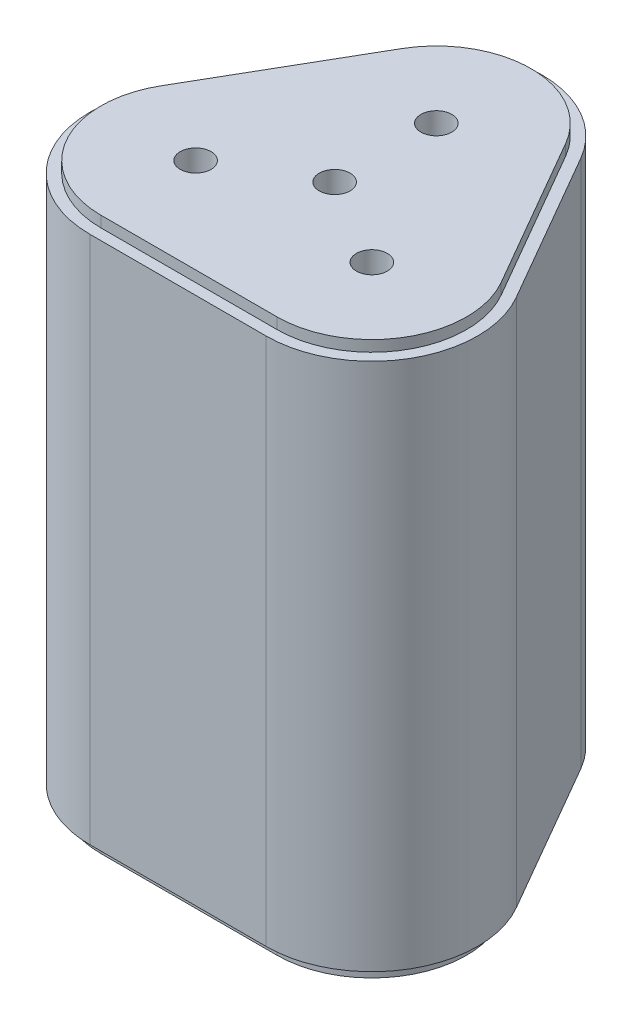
from build123d import *

# Parameters (mm, degrees)
EXTRUDE_1_DEPTH     = 60
CUT_EXTRUDE_1_DEPTH = 57
EXTRUDE_START       = 1.5
EXTRUDE_2_DEPTH     = 1.5
EXTRUDE_3_DEPTH     = 1.25
SKETCH_8_R          = 1.75
CUT_EXTRUDE_2_DEPTH = 67.788557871
SKETCH_9_R          = 1.75
CUT_EXTRUDE_3_DEPTH = 67.788557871


with BuildPart() as part:
    # Sketch 1 → Extrude 1 (new body)
    with BuildSketch(Plane(origin=(0, 0, 0), x_dir=(1, 0, 0), z_dir=(0, 1, 0))):
        with BuildLine():
            Line((10.392304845, 17.547005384), (20.392304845, 0.226497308))
            ThreePointArc((20.392304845, 0.226497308), (20.392304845, -11.773502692), (10, -17.773502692))
            Line((10, -17.773502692), (-10, -17.773502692))
            ThreePointArc((-10, -17.773502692), (-20.392304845, -11.773502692), (-20.392304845, 0.226497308))
            Line((-20.392304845, 0.226497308), (-10.392304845, 17.547005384))
            ThreePointArc((-10.392304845, 17.547005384), (0, 23.547005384), (10.392304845, 17.547005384))
        make_face()
    extrude(amount=EXTRUDE_1_DEPTH)

    # Sketch 2 → Cut-Extrude 1 (cut)
    with BuildSketch(Plane.XZ):
        with BuildLine():
            Line((-10, 15.273502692), (10, 15.273502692))
            ThreePointArc((10, 15.273502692), (18.227241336, 10.523502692), (18.227241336, 1.023502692))
            Line((18.227241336, 1.023502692), (8.227241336, -16.297005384))
            ThreePointArc((8.227241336, -16.297005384), (0, -21.047005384), (-8.227241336, -16.297005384))
            Line((-8.227241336, -16.297005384), (-18.227241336, 1.023502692))
            ThreePointArc((-18.227241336, 1.023502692), (-18.227241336, 10.523502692), (-10, 15.273502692))
        make_face()
    extrude(amount=-CUT_EXTRUDE_1_DEPTH, mode=Mode.SUBTRACT)

    # Sketch 3 → Extrude 2 (add)
    with BuildSketch(Plane.XZ.offset(EXTRUDE_START)):
        with BuildLine():
            Line((9.309773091, -16.922005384), (19.309773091, 0.398502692))
            ThreePointArc((19.309773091, 0.398502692), (19.309773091, 11.148502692), (10, 16.523502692))
            Line((10, 16.523502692), (-10, 16.523502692))
            ThreePointArc((-10, 16.523502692), (-19.309773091, 11.148502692), (-19.309773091, 0.398502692))
            Line((-19.309773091, 0.398502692), (-9.309773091, -16.922005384))
            ThreePointArc((-9.309773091, -16.922005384), (0, -22.297005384), (9.309773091, -16.922005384))
        make_face()
        with BuildLine():
            Line((-18.227241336, 1.023502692), (-8.227241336, -16.297005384))
            ThreePointArc((-8.227241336, -16.297005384), (0, -21.047005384), (8.227241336, -16.297005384))
            Line((8.227241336, -16.297005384), (18.227241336, 1.023502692))
            ThreePointArc((18.227241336, 1.023502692), (18.227241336, 10.523502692), (10, 15.273502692))
            Line((10, 15.273502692), (-10, 15.273502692))
            ThreePointArc((-10, 15.273502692), (-18.227241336, 10.523502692), (-18.227241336, 1.023502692))
        make_face(mode=Mode.SUBTRACT)
    extrude(amount=-EXTRUDE_2_DEPTH)

    # Sketch 7 → Extrude 3 (add)
    with BuildSketch(Plane(origin=(0, 60, 0), x_dir=(1, 0, 0), z_dir=(0, 1, 0))):
        with BuildLine():
            Line((-9.309773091, 16.922005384), (-19.309773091, -0.398502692))
            ThreePointArc((-19.309773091, -0.398502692), (-19.309773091, -11.148502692), (-10, -16.523502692))
            Line((-10, -16.523502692), (10, -16.523502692))
            ThreePointArc((10, -16.523502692), (19.309773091, -11.148502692), (19.309773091, -0.398502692))
            Line((19.309773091, -0.398502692), (9.309773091, 16.922005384))
            ThreePointArc((9.309773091, 16.922005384), (0, 22.297005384), (-9.309773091, 16.922005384))
        make_face()
    extrude(amount=EXTRUDE_3_DEPTH)

    # Sketch 8 → Cut-Extrude 2 (cut, through all)
    with BuildSketch(Plane.XZ.offset(-57)):
        with Locations(Location((0, 0, 0), (0, 0, 270))):
            Circle(SKETCH_8_R)
    extrude(amount=-CUT_EXTRUDE_2_DEPTH, mode=Mode.SUBTRACT)

    # Sketch 9 → Cut-Extrude 3 (cut, through all)
    with BuildSketch(Plane.XZ.offset(-57)):
        with Locations(Location((10, 5.773502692, 0), (0, 0, 270))):
            Circle(SKETCH_9_R)
        with Locations(Location((-10, 5.773502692, 0), (0, 0, 270))):
            Circle(SKETCH_9_R)
        with Locations(Location((0, -11.547005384, 0), (0, 0, 270))):
            Circle(SKETCH_9_R)
    extrude(amount=-CUT_EXTRUDE_3_DEPTH, mode=Mode.SUBTRACT)


solid = part.part
